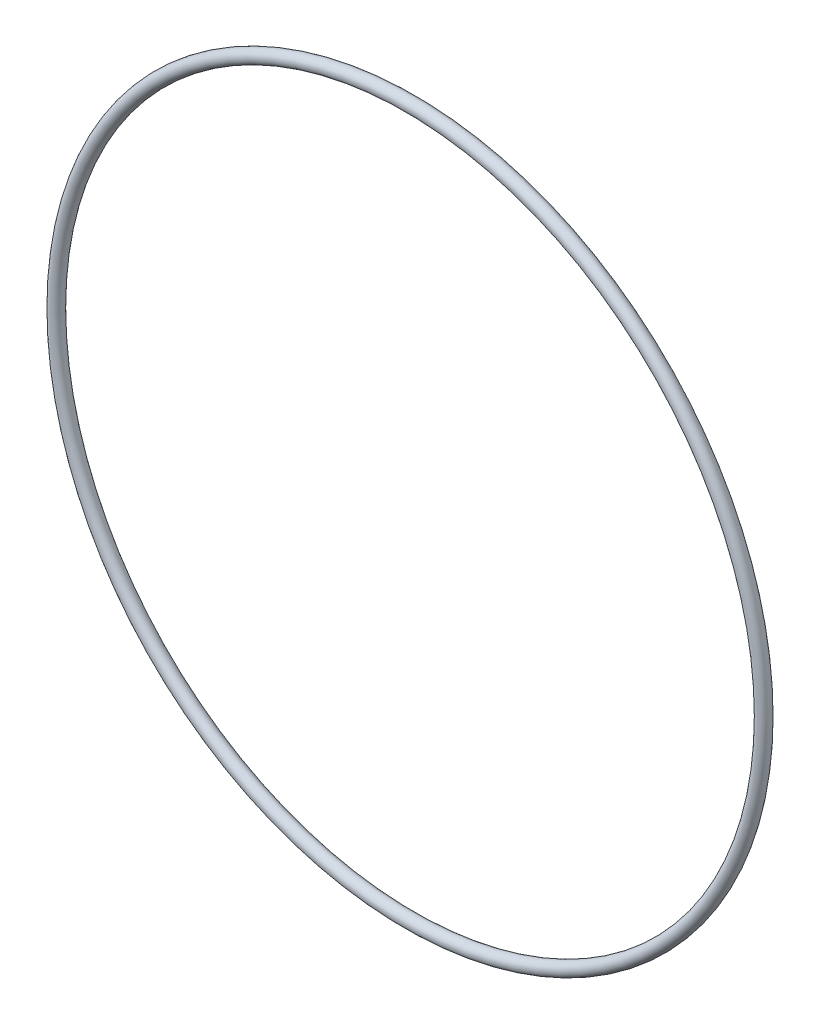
ISO-10303-21;
HEADER;
FILE_DESCRIPTION(('STEP AP214'),'2;1');
FILE_NAME('part.step','',(''),(''),'','','');
FILE_SCHEMA(('AUTOMOTIVE_DESIGN { 1 0 10303 214 1 1 1 1 }'));
ENDSEC;
DATA;
#1=APPLICATION_CONTEXT('core data for automotive mechanical design processes');
#2=APPLICATION_PROTOCOL_DEFINITION('international standard','automotive_design',2000,#1);
#3=PRODUCT_CONTEXT('',#1,'mechanical');
#4=PRODUCT('Part','Part','',(#3));
#5=PRODUCT_RELATED_PRODUCT_CATEGORY('part','',(#4));
#6=PRODUCT_DEFINITION_FORMATION('','',#4);
#7=PRODUCT_DEFINITION_CONTEXT('part definition',#1,'design');
#8=PRODUCT_DEFINITION('design','',#6,#7);
#9=PRODUCT_DEFINITION_SHAPE('','',#8);
#10=(LENGTH_UNIT() NAMED_UNIT(*) SI_UNIT(.MILLI.,.METRE.));
#11=(NAMED_UNIT(*) PLANE_ANGLE_UNIT() SI_UNIT($,.RADIAN.));
#12=(NAMED_UNIT(*) SI_UNIT($,.STERADIAN.) SOLID_ANGLE_UNIT());
#13=UNCERTAINTY_MEASURE_WITH_UNIT(LENGTH_MEASURE(1.E-05),#10,'distance_accuracy_value','');
#14=(GEOMETRIC_REPRESENTATION_CONTEXT(3) GLOBAL_UNCERTAINTY_ASSIGNED_CONTEXT((#13)) GLOBAL_UNIT_ASSIGNED_CONTEXT((#10,
#11,#12)) REPRESENTATION_CONTEXT('',''));
#15=CARTESIAN_POINT('',(0.,0.,0.));
#16=DIRECTION('',(0.,0.,1.));
#17=DIRECTION('',(1.,0.,0.));
#18=AXIS2_PLACEMENT_3D('',#15,#16,#17);
#19=CARTESIAN_POINT('',(0.,0.,0.));
#20=DIRECTION('',(0.,0.,1.));
#21=DIRECTION('',(1.,0.,0.));
#22=AXIS2_PLACEMENT_3D('',#19,#20,#21);
#23=TOROIDAL_SURFACE('',#22,142.0495,2.66699999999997);
#24=CARTESIAN_POINT('',(144.7165,0.,0.));
#25=VERTEX_POINT('',#24);
#26=VERTEX_LOOP('',#25);
#27=FACE_BOUND('',#26,.T.);
#28=ADVANCED_FACE('F28',(#27),#23,.T.);
#29=CLOSED_SHELL('',(#28));
#30=MANIFOLD_SOLID_BREP('B2',#29);
#31=ADVANCED_BREP_SHAPE_REPRESENTATION('',(#18,#30),#14);
#32=SHAPE_DEFINITION_REPRESENTATION(#9,#31);
ENDSEC;
END-ISO-10303-21;
